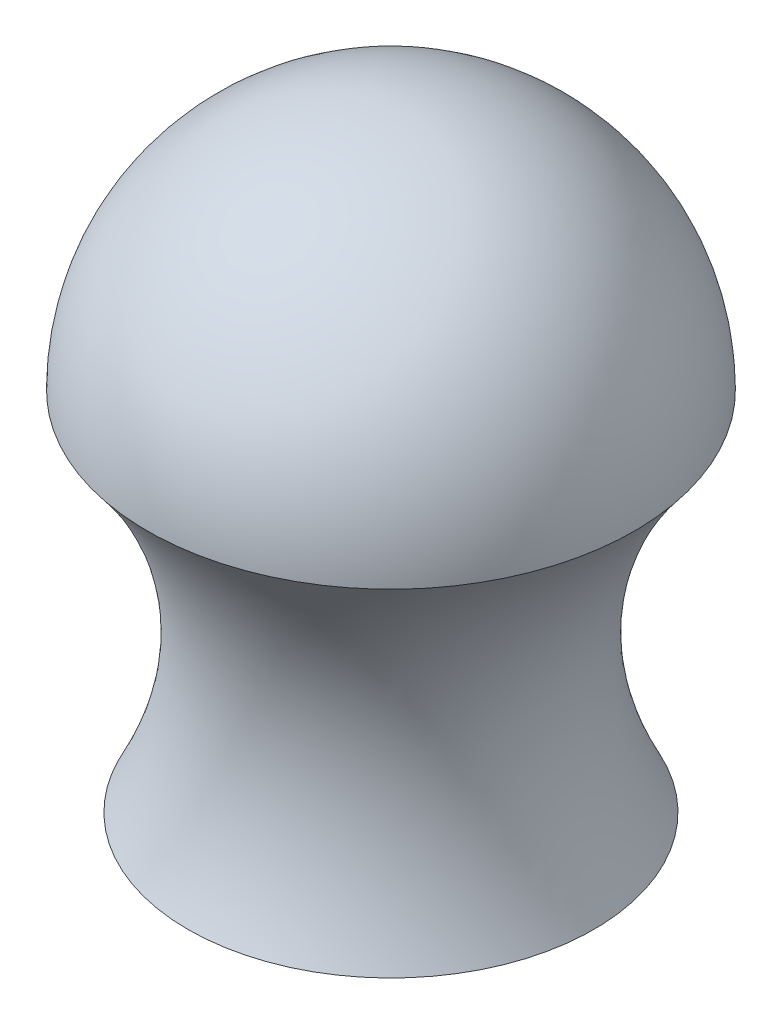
from build123d import *

# Parameters (mm, degrees)
SKETCH3_R          = 2.54
CUT_EXTRUDE1_DEPTH = 10.16


with BuildPart() as part:
    # Sketch2 → Revolve1 (revolve)
    with BuildSketch(Plane(origin=(0, 0, 0), x_dir=(0, 0, -1), z_dir=(1, 0, 0))):
        with BuildLine():
            Line((12.7, -22.86), (0, -22.86))
            Line((0, -22.86), (0, 15.24))
            ThreePointArc((0, 15.24), (10.776307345, 10.776307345), (15.24, 0))
            add(Edge.make_bspline(
                [(15.24, 0), (6.582405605, -10.777723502), (12.7, -22.86)],
                knots=[0, 0, 0, 1, 1, 1], degree=2))
        make_face()
    revolve(axis=Axis((0, -22.86, 0), (0, 1, 0)))

    # Sketch3 → Cut-Extrude1 (cut)
    with BuildSketch(Plane.XZ.offset(22.86)):
        with Locations(Location((0, 0, 0), (0, 0, 270))):
            Circle(SKETCH3_R)
    extrude(amount=-CUT_EXTRUDE1_DEPTH, mode=Mode.SUBTRACT)


solid = part.part
